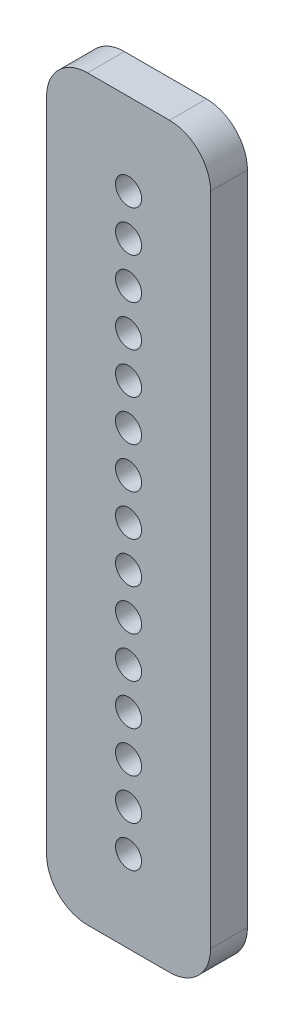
from build123d import *

# Parameters (mm, degrees)
SKETCH1_W           = 25.4
SKETCH1_H           = 114.3
BOSS_EXTRUDE1_DEPTH = 5.715
SKETCH2_R           = 2.0193
CUT_EXTRUDE1_DEPTH  = 5.715
FILLET1_R           = 6.35


with BuildPart() as part:
    # Sketch1 → Boss-Extrude1 (new body)
    with BuildSketch(Plane.XY):
        Rectangle(SKETCH1_W, SKETCH1_H)
    extrude(amount=BOSS_EXTRUDE1_DEPTH)

    # Sketch2 → Cut-Extrude1 (cut)
    with BuildSketch(Plane.XY.offset(5.715)):
        Circle(SKETCH2_R)
        with Locations((0, 6.35)):
            Circle(SKETCH2_R)
        with Locations((0, 12.7)):
            Circle(SKETCH2_R)
        with Locations((0, 19.05)):
            Circle(SKETCH2_R)
        with Locations((0, 25.4)):
            Circle(SKETCH2_R)
        with Locations((0, 31.75)):
            Circle(SKETCH2_R)
        with Locations((0, 38.1)):
            Circle(SKETCH2_R)
        with Locations((0, 44.45)):
            Circle(SKETCH2_R)
        with Locations((0, -6.35)):
            Circle(SKETCH2_R)
        with Locations((0, -12.7)):
            Circle(SKETCH2_R)
        with Locations((0, -19.05)):
            Circle(SKETCH2_R)
        with Locations((0, -25.4)):
            Circle(SKETCH2_R)
        with Locations((0, -31.75)):
            Circle(SKETCH2_R)
        with Locations((0, -38.1)):
            Circle(SKETCH2_R)
        with Locations((0, -44.45)):
            Circle(SKETCH2_R)
    extrude(amount=-CUT_EXTRUDE1_DEPTH, mode=Mode.SUBTRACT)

    # Fillet1
    fillet1_edges = [part.edges().sort_by_distance(p)[0] for p in [
        (12.7, -57.15, 2.8575),
        (-12.7, -57.15, 2.8575),
        (-12.7, 57.15, 2.8575),
        (12.7, 57.15, 2.8575),
    ]]
    fillet(fillet1_edges, radius=FILLET1_R)


solid = part.part
